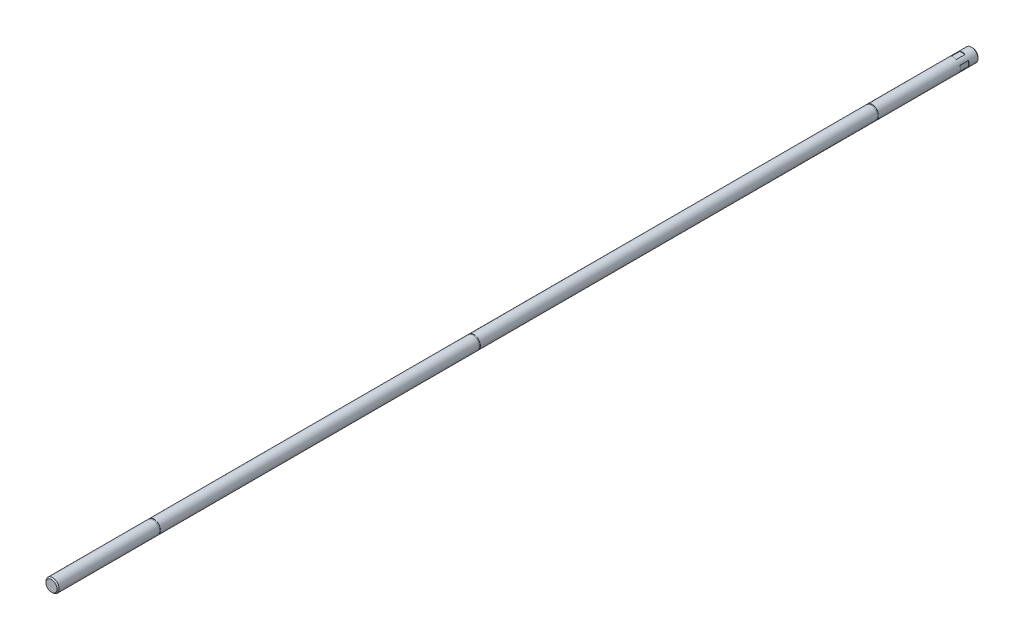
from build123d import *

# Parameters (mm, degrees)
SKETCH_1_R               = 6
EXTRUDE_1_DEPTH          = 835
CUT_EXTRUDE_START        = 9
SKETCH_2_W               = 4.795831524
SKETCH_2_H               = 5
CUT_EXTRUDE_1_DEPTH      = 8
PATTERN_CIRCULAR_1_COUNT = 4
SKETCH_4_W               = 0.25
SKETCH_4_H               = 1.1
CHAMFER_2_SIZE           = 1


with BuildPart() as part:
    # Sketch 1 → Extrude 1 (new body)
    with BuildSketch(Plane.XY):
        Circle(SKETCH_1_R)
    extrude(amount=EXTRUDE_1_DEPTH)

    # Sketch 2 → Cut-Extrude 1 (cut)
    with BuildSketch(Plane.XY.offset(CUT_EXTRUDE_START)):
        with Locations((0, 8)):
            Rectangle(SKETCH_2_W, SKETCH_2_H)
    cut_extrude_1 = extrude(amount=CUT_EXTRUDE_1_DEPTH, mode=Mode.SUBTRACT)

    # Pattern Circular 1: Cut-Extrude 1 ×4 about axis
    pattern_circular_1_axis = Axis((0, 0, 0), (0, 0, 1))
    for i in range(1, PATTERN_CIRCULAR_1_COUNT):
        add(cut_extrude_1.rotate(pattern_circular_1_axis, i * 360 / PATTERN_CIRCULAR_1_COUNT), mode=Mode.SUBTRACT)

    # Sketch 4 → Cut-Revolve 1 (revolve, cut)
    with BuildSketch(Plane(origin=(0, 0, 0), x_dir=(1, 0, 0), z_dir=(0, 1, 0))):
        with Locations((5.875, -742.65)):
            Rectangle(SKETCH_4_W, SKETCH_4_H)
        with Locations((5.875, -91.55)):
            Rectangle(SKETCH_4_W, SKETCH_4_H)
        with Locations((5.875, -452.65)):
            Rectangle(SKETCH_4_W, SKETCH_4_H)
    revolve(axis=Axis((0, 0, 835), (0, 0, -1)), mode=Mode.SUBTRACT)

    # Chamfer 2
    chamfer_2_edges = [part.edges().sort_by_distance(p)[0] for p in [
        (-6, 0, 0),
        (-6, 0, 835),
    ]]
    chamfer(chamfer_2_edges, length=CHAMFER_2_SIZE)


solid = part.part
